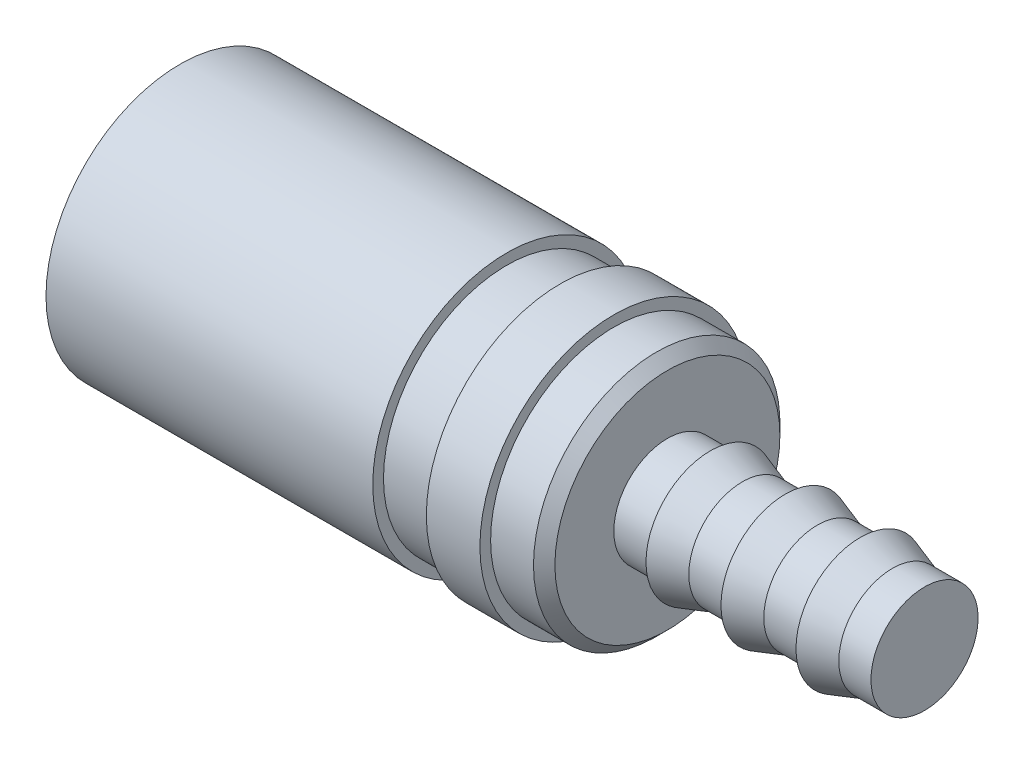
from build123d import *

# Parameters (mm, degrees)
CHAFL_N1_SIZE = 1


with BuildPart() as part:
    # Croquis1 → Revoluci_n1 (revolve)
    with BuildSketch(Plane.XY, mode=Mode.PRIVATE) as revoluci_n1_sk:
        Polygon((0, 0), (0, 12.5), (30.5, 12.5), (30.5, 11.5), (35.5, 11.5), (35.5, 12.5), (40.5, 12.5), (40.5, 11.5), (45.5, 11.5), (45.5, 5), (49.5, 5), (49.5, 6), (52.5, 5), (56.5, 5), (56.5, 6), (59.5, 5), (63.5, 5), (63.5, 6), (66.5, 5), (69.5, 5), (69.5, 0), align=None)
    revolve(revoluci_n1_sk.sketch.rotate(Axis((0, 0, 0), (1, 0, 0)), 90), axis=Axis((0, 0, 0), (1, 0, 0)))

    # Chafl_n1
    chafl_n1_edges = [part.edges().sort_by_distance(p)[0] for p in [
        (45.5, 0, -11.5),
    ]]
    chamfer(chafl_n1_edges, length=CHAFL_N1_SIZE)


solid = part.part
